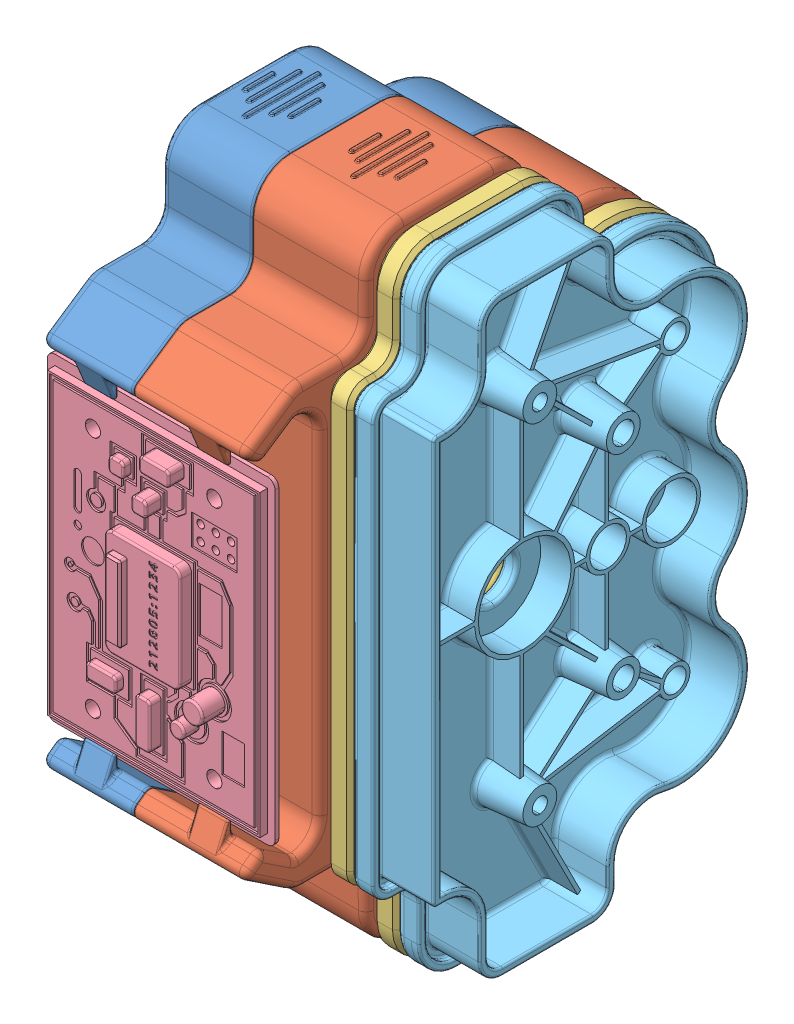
SolidWorks assembly EB BOTTOM.SLDASM, configuration EB BOTTOM (file format 16000). Lengths in mm.
Overall size (41.44 82.5 56.96).
6 component instances, 6 part files, 0 mates.
Components (placement in the parent):
- EB MID H1-1: EB MID H1.SLDPRT [EB MID H1] at (28.5656 0 0) size (21 82.5 55.09)
- EB MID H2-1: EB MID H2.SLDPRT [EB MID H2] at (55.5656 0 0) size (16 82.5 55.09)
- EB Coushion-1: EB Coushion.SLDPRT [EB Coushion] at (56.5656 0 0) size (3 82 45.5)
- EB Electronics 1-1: EB Electronics 1.SLDPRT [EB Electronics 1] at (42.126 0 23.9585) x (-1 0 0) z (0 0 -1) size (30 42 4.5)
- EB BOTTOM END-1: EB BOTTOM END.SLDPRT [EB BOTTOM END] at (59.5656 0 0) size (9.01 82 45.5)
- EB Electronics 2-1: EB Electronics 2.SLDPRT [EB Electronics 2] at (39.089 0 0) size (6.5 23.77 20.78)
